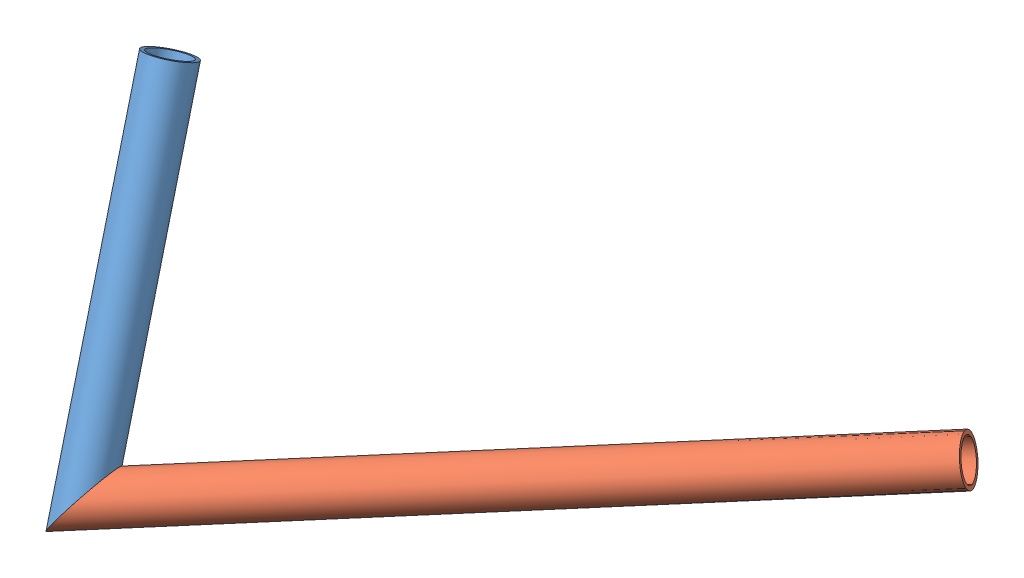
SolidWorks assembly ROHRBAUGRUPPE.SLDASM, configuration Standard (file format 11000). Lengths in mm.
Overall size (871.59 460.65 552.63).
2 component instances, 2 part files, 2 mates.
Components (placement in the parent):
- ROHR_1_BG-3: ROHR_1_BG.SLDPRT [Standard] at (-462.8036 -900.4865 -186.0021) x (-0.356239 -0.446301 -0.82092) z (-0.154944 0.89461 -0.419125) size (60 60 483.5)
- ROHR_2_BG-4: ROHR_2_BG.SLDPRT [Standard] at (346.736 -1114.0341 -465.2651) x (-0.378471 -0.479564 -0.791693) z (0.828793 0.205266 -0.520546) size (60 60 933.52)
Mates (geometry in assembly coordinates):
- Deckungsgleich3: coincident: line of ROHR_1_BG-3 through (-389.3933 -1324.3405 12.5739) axis (-0.154944 0.89461 -0.419125); point of assembly
- Deckungsgleich4: coincident: line of ROHR_2_BG-4 through (-460.3316 -1313.9198 41.6352) axis (0.828793 0.205266 -0.520546); point of assembly
